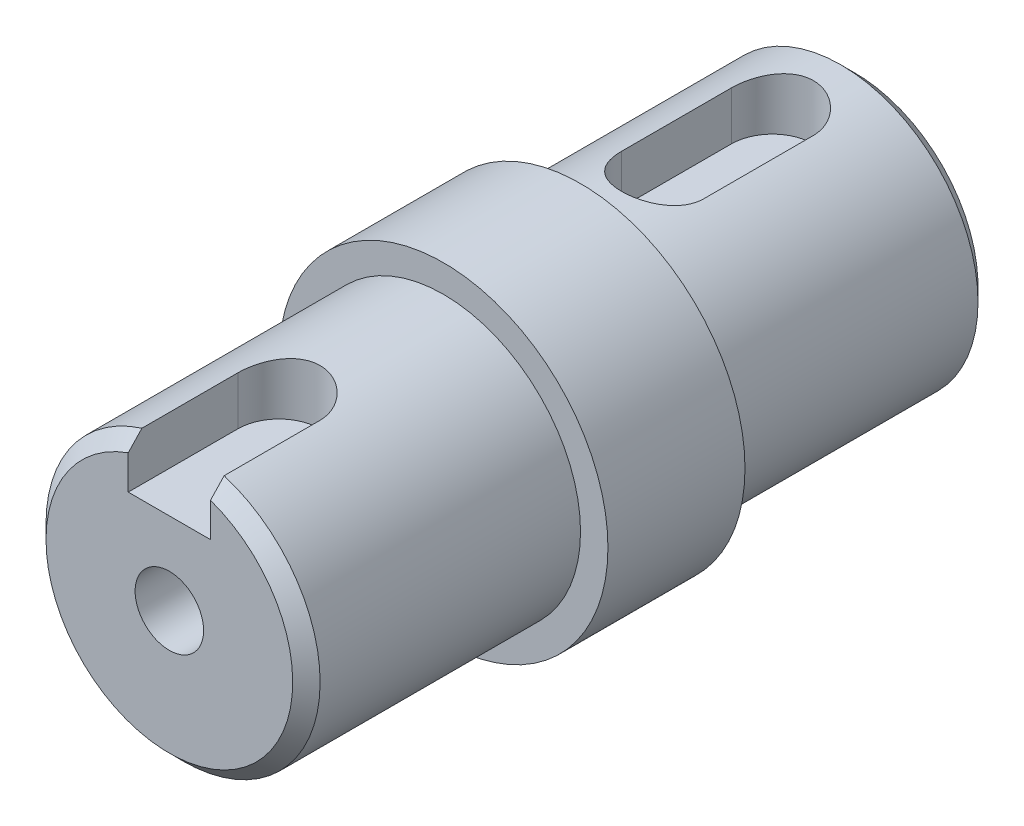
from build123d import *

# Parameters (mm, degrees)
ESQUISSE1_R               = 5
BOSS_EXTRU_1_DEPTH        = 10
ESQUISSE2_R               = 6
BOSS_EXTRU_2_DEPTH        = 5
BOSS_EXTRU_3_START        = 10
ESQUISSE3_R               = 5
BOSS_EXTRU_3_DEPTH        = 10
ENL_V_MAT_EXTRU_1_DEPTH   = 9
CHANFREIN1_SIZE           = 0.5
TROU_TARAUD_M3X0_51_D     = 2.5
TROU_TARAUD_M3X0_51_DEPTH = 8.5
TROU_TARAUD_M3X0_51_TIP   = 0.751075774


with BuildPart() as part:
    # Esquisse1 → Boss.-Extru.1 (new body)
    with BuildSketch(Plane.XY):
        Circle(ESQUISSE1_R)
    extrude(amount=BOSS_EXTRU_1_DEPTH)

    # Esquisse2 → Boss.-Extru.2 (add)
    with BuildSketch(Plane(origin=(0, 0, 0), x_dir=(-1, 0, 0), z_dir=(0, 0, -1))):
        Circle(ESQUISSE2_R)
    extrude(amount=BOSS_EXTRU_2_DEPTH)

    # Esquisse3 → Boss.-Extru.3 (add)
    with BuildSketch(Plane(origin=(0, 0, -5), x_dir=(-1, 0, 0), z_dir=(0, 0, -1)).offset(BOSS_EXTRU_3_START)):
        Circle(ESQUISSE3_R)
    extrude(amount=-BOSS_EXTRU_3_DEPTH)

    # Esquisse4 → Enl_v. mat.-Extru.1 (cut)
    with BuildSketch(Plane(origin=(0, 3, 0), x_dir=(1, 0, 0), z_dir=(0, 1, 0))):
        with BuildLine():
            Line((1.5, 12), (1.5, 8))
            ThreePointArc((1.5, 8), (0, 6.5), (-1.5, 8))
            Line((-1.5, 8), (-1.5, 12))
            ThreePointArc((-1.5, 12), (0, 13.5), (1.5, 12))
        make_face()
        with BuildLine():
            Line((-1.5, -12.401695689), (-1.5, -6))
            ThreePointArc((-1.5, -6), (0, -4.5), (1.5, -6))
            Line((1.5, -6), (1.5, -12.401695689))
            ThreePointArc((1.5, -12.401695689), (0, -13.901695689), (-1.5, -12.401695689))
        make_face()
    extrude(amount=ENL_V_MAT_EXTRU_1_DEPTH, mode=Mode.SUBTRACT)

    # Chanfrein1
    chanfrein1_edges = [part.edges().sort_by_distance(p)[0] for p in [
        (5, 0, -15),
        (-2.958039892, -4.031128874, 10),
    ]]
    chamfer(chanfrein1_edges, length=CHANFREIN1_SIZE)

    # Trou taraud_ M3x0.51
    with Locations(Plane.XY.offset(10)):
        with Locations((0, 0)):
            Hole(TROU_TARAUD_M3X0_51_D / 2, depth=TROU_TARAUD_M3X0_51_DEPTH)
            with Locations((0, 0, -(TROU_TARAUD_M3X0_51_DEPTH + TROU_TARAUD_M3X0_51_TIP / 2))):  # 118° drill point
                Cone(0, TROU_TARAUD_M3X0_51_D / 2, TROU_TARAUD_M3X0_51_TIP, mode=Mode.SUBTRACT)


solid = part.part
